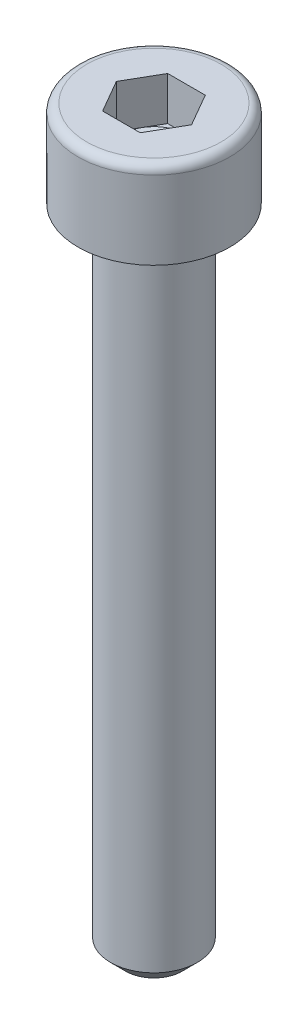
from build123d import *

# Parameters (mm, degrees)
TIGE_START              = -30
ESQUISSE1_R             = 2
TIGE_DEPTH              = 30
CHANFREIN_D_ENTR_E_SIZE = 0.7
HEXAGONE_DEPTH          = 2


with BuildPart() as part:
    # Esquisse1 → Tige (new body)
    with BuildSketch(Plane(origin=(0, 0, 0), x_dir=(1, 0, 0), z_dir=(0, 1, 0)).offset(TIGE_START)):
        with Locations(Location((0, 0, 0), (0, 0, 270))):
            Circle(ESQUISSE1_R)
    extrude(amount=TIGE_DEPTH)

    # Chanfrein d_entr_e
    chanfrein_d_entr_e_edges = [part.edges().sort_by_distance(p)[0] for p in [
        (0, -30, -2),
    ]]
    chamfer(chanfrein_d_entr_e_edges, length=CHANFREIN_D_ENTR_E_SIZE)

    # Esquisse2 → T_te (revolve)
    with BuildSketch(Plane.XY, mode=Mode.PRIVATE) as t_te_sk:
        with BuildLine():
            Line((1.5, 4), (1.5, 2))
            Line((1.5, 2), (0, 1.133974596))
            Line((0, 1.133974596), (0, 0))
            Line((0, 0), (3.5, 0))
            Line((3.5, 0), (3.5, 3.6))
            ThreePointArc((3.5, 3.6), (3.382842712, 3.882842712), (3.1, 4))
            Line((3.1, 4), (1.5, 4))
        make_face()
    revolve(t_te_sk.sketch.rotate(Axis((0, 4, 0), (0, -1, 0)), 180), axis=Axis((0, 4, 0), (0, -1, 0)))

    # Esquisse3 → Hexagone (cut)
    with BuildSketch(Plane(origin=(0, 4, -3), x_dir=(1, 0, 0), z_dir=(0, -1, 0))):
        Polygon((0.866025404, 4.5), (-0.866025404, 4.5), (-1.732050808, 3), (-0.866025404, 1.5), (0.866025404, 1.5), (1.732050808, 3), align=None)
    extrude(amount=HEXAGONE_DEPTH, mode=Mode.SUBTRACT)


solid = part.part
